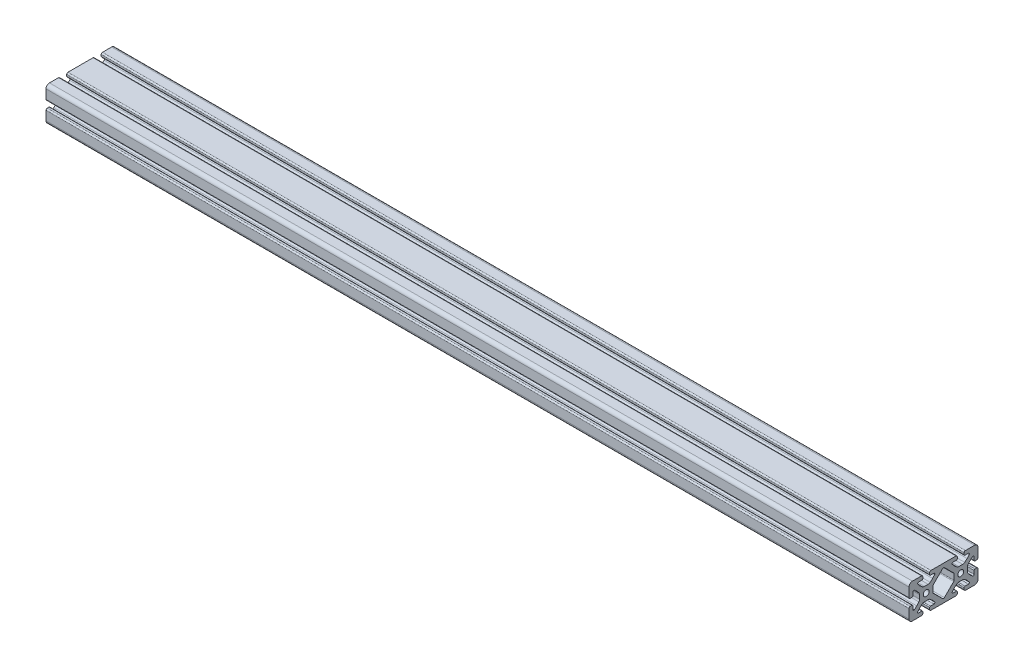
from build123d import *

# Parameters (mm, degrees)
MODEL_R                = 3.4
STRUKTURBAUTEIL1_DEPTH = 1000


with BuildPart() as part:
    # Model → Strukturbauteil1 (new body)
    with BuildSketch(Plane(origin=(0, 0, 0), x_dir=(0, 0, -1), z_dir=(1, 0, 0))):
        with BuildLine():
            Line((-36, -20), (-25.5, -20))
            ThreePointArc((-25.5, -20), (-24.439339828, -19.560660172), (-24, -18.5))
            Line((-24, -18.5), (-24, -16.5))
            ThreePointArc((-24, -16.5), (-24.292893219, -15.792893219), (-25, -15.5))
            Line((-25, -15.5), (-28.91611505, -15.5))
            ThreePointArc((-28.91611505, -15.5), (-29.883468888, -14.905025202), (-29.788807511, -13.773297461))
            Line((-29.788807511, -13.773297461), (-27.378794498, -10.963551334))
            Line((-27.378794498, -10.963551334), (-24.580305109, -8.54047619))
            ThreePointArc((-24.580305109, -8.54047619), (-23.45041558, -7.952757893), (-22.193056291, -7.75))
            Line((-22.193056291, -7.75), (-17.806943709, -7.75))
            ThreePointArc((-17.806943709, -7.75), (-16.54958442, -7.952757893), (-15.419694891, -8.54047619))
            Line((-15.419694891, -8.54047619), (-12.621205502, -10.963551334))
            Line((-12.621205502, -10.963551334), (-10.211192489, -13.773297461))
            ThreePointArc((-10.211192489, -13.773297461), (-10.116531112, -14.905025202), (-11.08388495, -15.5))
            Line((-11.08388495, -15.5), (-15, -15.5))
            ThreePointArc((-15, -15.5), (-15.707106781, -15.792893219), (-16, -16.5))
            Line((-16, -16.5), (-16, -18.5))
            ThreePointArc((-16, -18.5), (-15.560660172, -19.560660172), (-14.5, -20))
            Line((-14.5, -20), (14.5, -20))
            ThreePointArc((14.5, -20), (15.560660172, -19.560660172), (16, -18.5))
            Line((16, -18.5), (16, -16.5))
            ThreePointArc((16, -16.5), (15.707106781, -15.792893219), (15, -15.5))
            Line((15, -15.5), (11.08388495, -15.5))
            ThreePointArc((11.08388495, -15.5), (10.116531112, -14.905025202), (10.211192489, -13.773297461))
            Line((10.211192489, -13.773297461), (12.621205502, -10.963551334))
            Line((12.621205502, -10.963551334), (15.419694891, -8.54047619))
            ThreePointArc((15.419694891, -8.54047619), (16.54958442, -7.952757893), (17.806943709, -7.75))
            Line((17.806943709, -7.75), (22.193056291, -7.75))
            ThreePointArc((22.193056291, -7.75), (23.45041558, -7.952757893), (24.580305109, -8.54047619))
            Line((24.580305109, -8.54047619), (27.378794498, -10.963551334))
            Line((27.378794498, -10.963551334), (29.788807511, -13.773297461))
            ThreePointArc((29.788807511, -13.773297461), (29.883468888, -14.905025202), (28.91611505, -15.5))
            Line((28.91611505, -15.5), (25, -15.5))
            ThreePointArc((25, -15.5), (24.292893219, -15.792893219), (24, -16.5))
            Line((24, -16.5), (24, -18.5))
            ThreePointArc((24, -18.5), (24.439339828, -19.560660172), (25.5, -20))
            Line((25.5, -20), (36, -20))
            ThreePointArc((36, -20), (38.828427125, -18.828427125), (40, -16))
            Line((40, -16), (40, -5.5))
            ThreePointArc((40, -5.5), (39.560660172, -4.439339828), (38.5, -4))
            Line((38.5, -4), (36.5, -4))
            ThreePointArc((36.5, -4), (35.792893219, -4.292893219), (35.5, -5))
            Line((35.5, -5), (35.5, -8.91611505))
            ThreePointArc((35.5, -8.91611505), (34.905025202, -9.883468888), (33.773297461, -9.788807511))
            Line((33.773297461, -9.788807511), (30.963551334, -7.378794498))
            Line((30.963551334, -7.378794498), (28.54047619, -4.580305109))
            ThreePointArc((28.54047619, -4.580305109), (27.952757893, -3.45041558), (27.75, -2.193056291))
            Line((27.75, -2.193056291), (27.75, 2.193056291))
            ThreePointArc((27.75, 2.193056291), (27.952757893, 3.45041558), (28.54047619, 4.580305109))
            Line((28.54047619, 4.580305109), (30.963551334, 7.378794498))
            Line((30.963551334, 7.378794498), (33.773297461, 9.788807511))
            ThreePointArc((33.773297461, 9.788807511), (34.905025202, 9.883468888), (35.5, 8.91611505))
            Line((35.5, 8.91611505), (35.5, 5))
            ThreePointArc((35.5, 5), (35.792893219, 4.292893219), (36.5, 4))
            Line((36.5, 4), (38.5, 4))
            ThreePointArc((38.5, 4), (39.560660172, 4.439339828), (40, 5.5))
            Line((40, 5.5), (40, 16))
            ThreePointArc((40, 16), (38.828427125, 18.828427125), (36, 20))
            Line((36, 20), (25.5, 20))
            ThreePointArc((25.5, 20), (24.439339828, 19.560660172), (24, 18.5))
            Line((24, 18.5), (24, 16.5))
            ThreePointArc((24, 16.5), (24.292893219, 15.792893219), (25, 15.5))
            Line((25, 15.5), (28.91611505, 15.5))
            ThreePointArc((28.91611505, 15.5), (29.883468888, 14.905025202), (29.788807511, 13.773297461))
            Line((29.788807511, 13.773297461), (27.378794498, 10.963551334))
            Line((27.378794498, 10.963551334), (24.580305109, 8.54047619))
            ThreePointArc((24.580305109, 8.54047619), (23.45041558, 7.952757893), (22.193056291, 7.75))
            Line((22.193056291, 7.75), (17.806943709, 7.75))
            ThreePointArc((17.806943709, 7.75), (16.54958442, 7.952757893), (15.419694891, 8.54047619))
            Line((15.419694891, 8.54047619), (12.621205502, 10.963551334))
            Line((12.621205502, 10.963551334), (10.211192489, 13.773297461))
            ThreePointArc((10.211192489, 13.773297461), (10.116531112, 14.905025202), (11.08388495, 15.5))
            Line((11.08388495, 15.5), (15, 15.5))
            ThreePointArc((15, 15.5), (15.707106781, 15.792893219), (16, 16.5))
            Line((16, 16.5), (16, 18.5))
            ThreePointArc((16, 18.5), (15.560660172, 19.560660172), (14.5, 20))
            Line((14.5, 20), (-14.5, 20))
            ThreePointArc((-14.5, 20), (-15.560660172, 19.560660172), (-16, 18.5))
            Line((-16, 18.5), (-16, 16.5))
            ThreePointArc((-16, 16.5), (-15.707106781, 15.792893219), (-15, 15.5))
            Line((-15, 15.5), (-11.08388495, 15.5))
            ThreePointArc((-11.08388495, 15.5), (-10.116531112, 14.905025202), (-10.211192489, 13.773297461))
            Line((-10.211192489, 13.773297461), (-12.621205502, 10.963551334))
            Line((-12.621205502, 10.963551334), (-15.419694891, 8.54047619))
            ThreePointArc((-15.419694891, 8.54047619), (-16.54958442, 7.952757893), (-17.806943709, 7.75))
            Line((-17.806943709, 7.75), (-22.193056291, 7.75))
            ThreePointArc((-22.193056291, 7.75), (-23.45041558, 7.952757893), (-24.580305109, 8.54047619))
            Line((-24.580305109, 8.54047619), (-27.378794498, 10.963551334))
            Line((-27.378794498, 10.963551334), (-29.788807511, 13.773297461))
            ThreePointArc((-29.788807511, 13.773297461), (-29.883468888, 14.905025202), (-28.91611505, 15.5))
            Line((-28.91611505, 15.5), (-25, 15.5))
            ThreePointArc((-25, 15.5), (-24.292893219, 15.792893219), (-24, 16.5))
            Line((-24, 16.5), (-24, 18.5))
            ThreePointArc((-24, 18.5), (-24.439339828, 19.560660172), (-25.5, 20))
            Line((-25.5, 20), (-36, 20))
            ThreePointArc((-36, 20), (-38.828427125, 18.828427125), (-40, 16))
            Line((-40, 16), (-40, 5.5))
            ThreePointArc((-40, 5.5), (-39.560660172, 4.439339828), (-38.5, 4))
            Line((-38.5, 4), (-36.5, 4))
            ThreePointArc((-36.5, 4), (-35.792893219, 4.292893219), (-35.5, 5))
            Line((-35.5, 5), (-35.5, 8.91611505))
            ThreePointArc((-35.5, 8.91611505), (-34.905025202, 9.883468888), (-33.773297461, 9.788807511))
            Line((-33.773297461, 9.788807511), (-30.963551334, 7.378794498))
            Line((-30.963551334, 7.378794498), (-28.54047619, 4.580305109))
            ThreePointArc((-28.54047619, 4.580305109), (-27.952757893, 3.45041558), (-27.75, 2.193056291))
            Line((-27.75, 2.193056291), (-27.75, -2.193056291))
            ThreePointArc((-27.75, -2.193056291), (-27.952757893, -3.45041558), (-28.54047619, -4.580305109))
            Line((-28.54047619, -4.580305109), (-30.963551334, -7.378794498))
            Line((-30.963551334, -7.378794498), (-33.773297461, -9.788807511))
            ThreePointArc((-33.773297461, -9.788807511), (-34.905025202, -9.883468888), (-35.5, -8.91611505))
            Line((-35.5, -8.91611505), (-35.5, -5))
            ThreePointArc((-35.5, -5), (-35.792893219, -4.292893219), (-36.5, -4))
            Line((-36.5, -4), (-38.5, -4))
            ThreePointArc((-38.5, -4), (-39.560660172, -4.439339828), (-40, -5.5))
            Line((-40, -5.5), (-40, -16))
            ThreePointArc((-40, -16), (-38.828427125, -18.828427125), (-36, -20))
        make_face()
        with Locations((-20, 0)):
            Circle(MODEL_R, mode=Mode.SUBTRACT)
        with Locations((20, 0)):
            Circle(MODEL_R, mode=Mode.SUBTRACT)
        with BuildLine():
            Line((-11.810660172, -4.30695316), (-1.060660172, -15.05695316))
            ThreePointArc((-1.060660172, -15.05695316), (0, -15.496292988), (1.060660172, -15.05695316))
            Line((1.060660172, -15.05695316), (11.810660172, -4.30695316))
            ThreePointArc((11.810660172, -4.30695316), (12.135819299, -3.820318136), (12.25, -3.246292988))
            Line((12.25, -3.246292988), (12.25, 3.246292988))
            ThreePointArc((12.25, 3.246292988), (12.135819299, 3.820318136), (11.810660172, 4.30695316))
            Line((11.810660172, 4.30695316), (1.060660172, 15.05695316))
            ThreePointArc((1.060660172, 15.05695316), (0, 15.496292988), (-1.060660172, 15.05695316))
            Line((-1.060660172, 15.05695316), (-11.810660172, 4.30695316))
            ThreePointArc((-11.810660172, 4.30695316), (-12.135819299, 3.820318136), (-12.25, 3.246292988))
            Line((-12.25, 3.246292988), (-12.25, -3.246292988))
            ThreePointArc((-12.25, -3.246292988), (-12.135819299, -3.820318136), (-11.810660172, -4.30695316))
        make_face(mode=Mode.SUBTRACT)
    extrude(amount=STRUKTURBAUTEIL1_DEPTH)


solid = part.part
